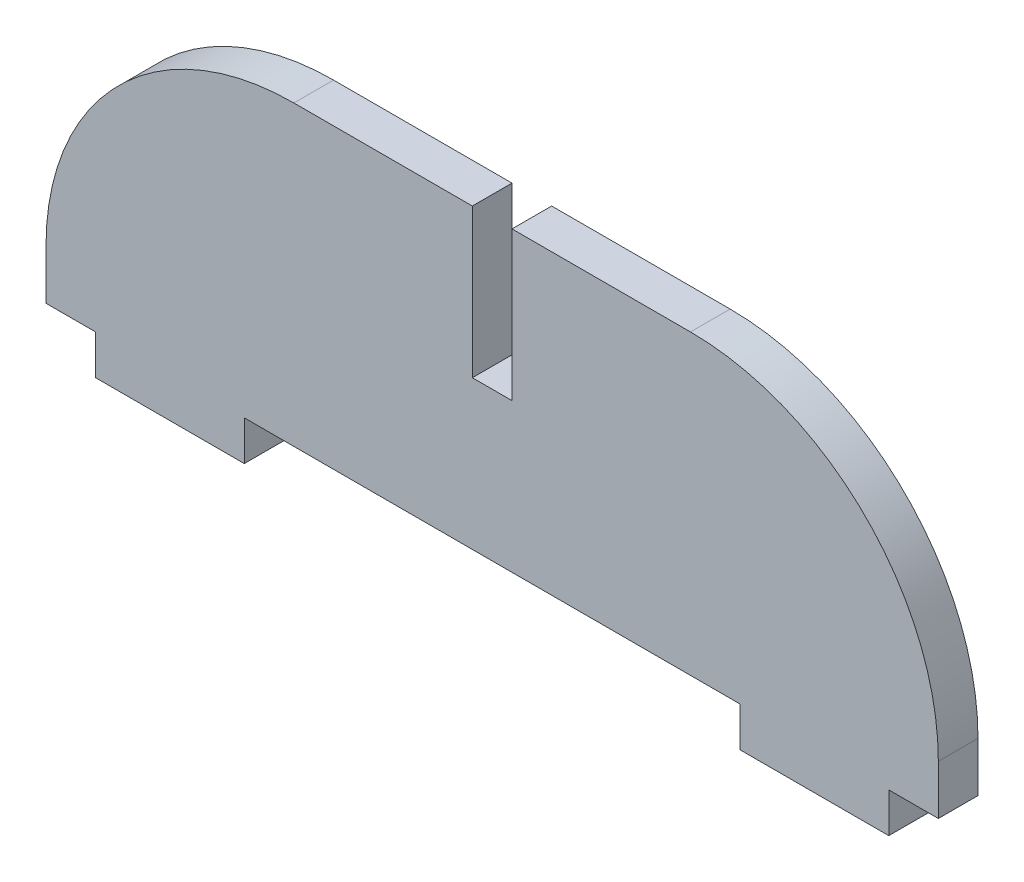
from build123d import *

# Parameters (mm, degrees)
BOSS_EXTRUDE1_DEPTH = 2


with BuildPart() as part:
    # Sketch1 → Boss-Extrude1 (new, symmetric)
    with BuildSketch(Plane.XY):
        with BuildLine():
            Line((-45, 0), (-40, 0))
            Line((-40, 0), (-40, -4))
            Line((-40, -4), (-25, -4))
            Line((-25, -4), (-25, 0))
            Line((-25, 0), (25, 0))
            Line((25, 0), (25, -4))
            Line((25, -4), (40, -4))
            Line((40, -4), (40, 0))
            Line((40, 0), (45, 0))
            Line((45, 0), (45, 5))
            ThreePointArc((45, 5), (37.67766953, 22.67766953), (20, 30))
            Line((20, 30), (2, 30))
            Line((2, 30), (2, 15))
            Line((2, 15), (-2, 15))
            Line((-2, 15), (-2, 30))
            Line((-2, 30), (-20, 30))
            ThreePointArc((-20, 30), (-37.67766953, 22.67766953), (-45, 5))
            Line((-45, 5), (-45, 0))
        make_face()
    extrude(amount=BOSS_EXTRUDE1_DEPTH, both=True)


solid = part.part
